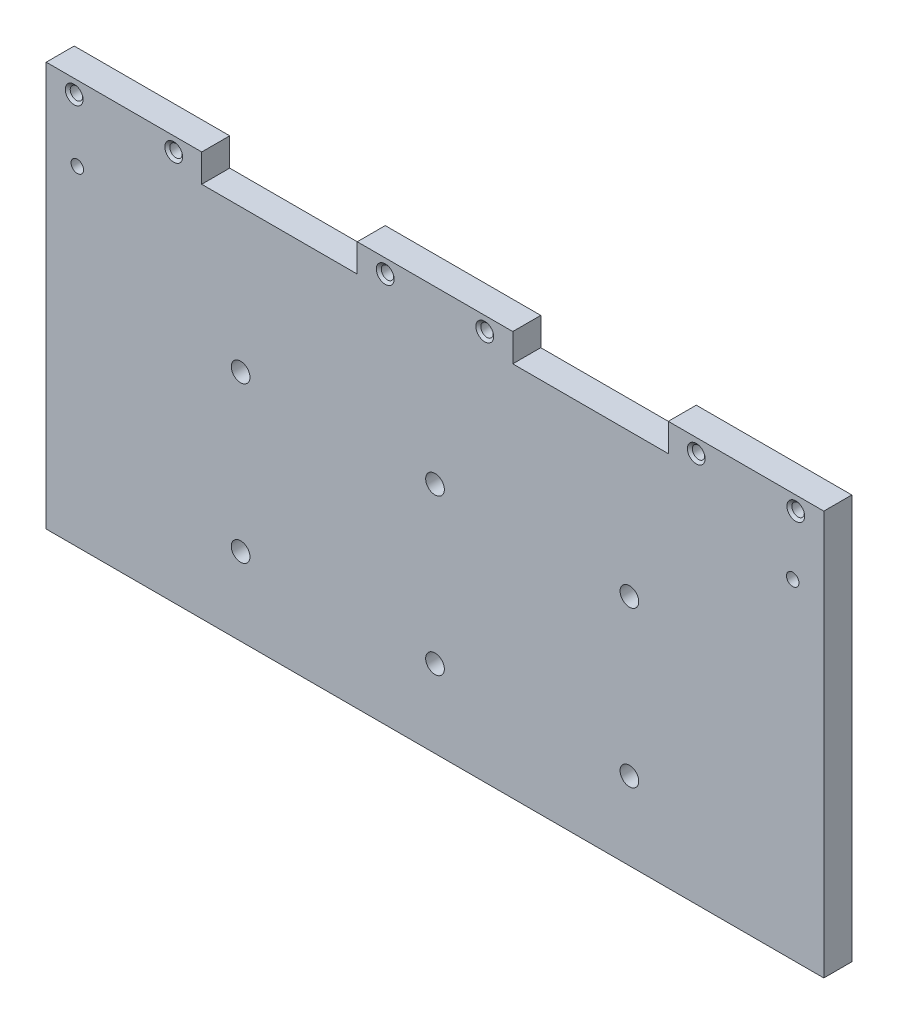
from build123d import *

# Parameters (mm, degrees)
EXTRUDE_1_DEPTH                 = 9
SKETCH_2_R                      = 2
CUT_EXTRUDE_2_DEPTH             = 9
HOLE_WIZARD_4_100_2_D           = 3.2639
HOLE_WIZARD_4_100_2_CSINK_D     = 5.715
HOLE_WIZARD_4_100_2_CSINK_ANGLE = 100
SKETCH_11_R                     = 2
CUT_EXTRUDE_3_DEPTH             = 10
SKETCH_12_R                     = 3
CUT_EXTRUDE_4_DEPTH             = 10


with BuildPart() as part:
    # Sketch 1 → Extrude 1 (new body)
    with BuildSketch(Plane.XY):
        Polygon((-49.003050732, 68.952265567), (0.996949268, 68.952265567), (0.996949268, 59.952265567), (50.996949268, 59.952265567), (50.996949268, 68.952265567), (100.996949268, 68.952265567), (100.996949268, 59.952265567), (150.996949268, 59.952265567), (150.996949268, 68.952265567), (200.996949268, 68.952265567), (200.996949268, -61.047734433), (-49.003050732, -61.047734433), align=None)
    extrude(amount=EXTRUDE_1_DEPTH)

    # Sketch 2 → Cut-Extrude 2 (cut)
    with BuildSketch(Plane.XY.offset(9)):
        with Locations((59.996949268, 64.452265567)):
            Circle(SKETCH_2_R)
        with Locations((-8.003050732, 64.452265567)):
            Circle(SKETCH_2_R)
        with Locations((-40.003050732, 64.452265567)):
            Circle(SKETCH_2_R)
        with Locations(Location((91.996949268, 64.452265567, 0), (0, 0, 180))):
            Circle(SKETCH_2_R)
        with Locations(Location((191.996949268, 64.452265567, 0), (0, 0, 180))):
            Circle(SKETCH_2_R)
        with Locations(Location((159.996949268, 64.452265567, 0), (0, 0, 180))):
            Circle(SKETCH_2_R)
    extrude(amount=-CUT_EXTRUDE_2_DEPTH, mode=Mode.SUBTRACT)

    # Hole Wizard 4_100_2 (through all)
    with Locations(Plane(origin=(-40.003050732, 64.452265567, 9), x_dir=(1, 0, 0), z_dir=(0, 0, 1))):
        with Locations((0, 0), (32, 0), (100, 0), (132, 0), (232, 0), (200, 0)):
            CounterSinkHole(HOLE_WIZARD_4_100_2_D / 2, HOLE_WIZARD_4_100_2_CSINK_D / 2, counter_sink_angle=HOLE_WIZARD_4_100_2_CSINK_ANGLE)

    # Sketch 11 → Cut-Extrude 3 (cut)
    with BuildSketch(Plane(origin=(0, 0, 0), x_dir=(-1, 0, 0), z_dir=(0, 0, -1))):
        with Locations((-190.996949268, 44.952265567)):
            Circle(SKETCH_11_R)
        with Locations((39.003050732, 44.952265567)):
            Circle(SKETCH_11_R)
    extrude(amount=-CUT_EXTRUDE_3_DEPTH, mode=Mode.SUBTRACT)

    # Sketch 12 → Cut-Extrude 4 (cut)
    with BuildSketch(Plane(origin=(0, 0, 0), x_dir=(-1, 0, 0), z_dir=(0, 0, -1))):
        with Locations((-138.496949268, 13.952265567)):
            Circle(SKETCH_12_R)
        with Locations((-75.996949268, -36.047734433)):
            Circle(SKETCH_12_R)
        with Locations((-75.996949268, 13.952265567)):
            Circle(SKETCH_12_R)
        with Locations((-138.496949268, -36.047734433)):
            Circle(SKETCH_12_R)
        with Locations(Location((-13.496949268, 13.952265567, 0), (0, 0, 180))):
            Circle(SKETCH_12_R)
        with Locations(Location((-13.496949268, -36.047734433, 0), (0, 0, 180))):
            Circle(SKETCH_12_R)
    extrude(amount=-CUT_EXTRUDE_4_DEPTH, mode=Mode.SUBTRACT)


solid = part.part
